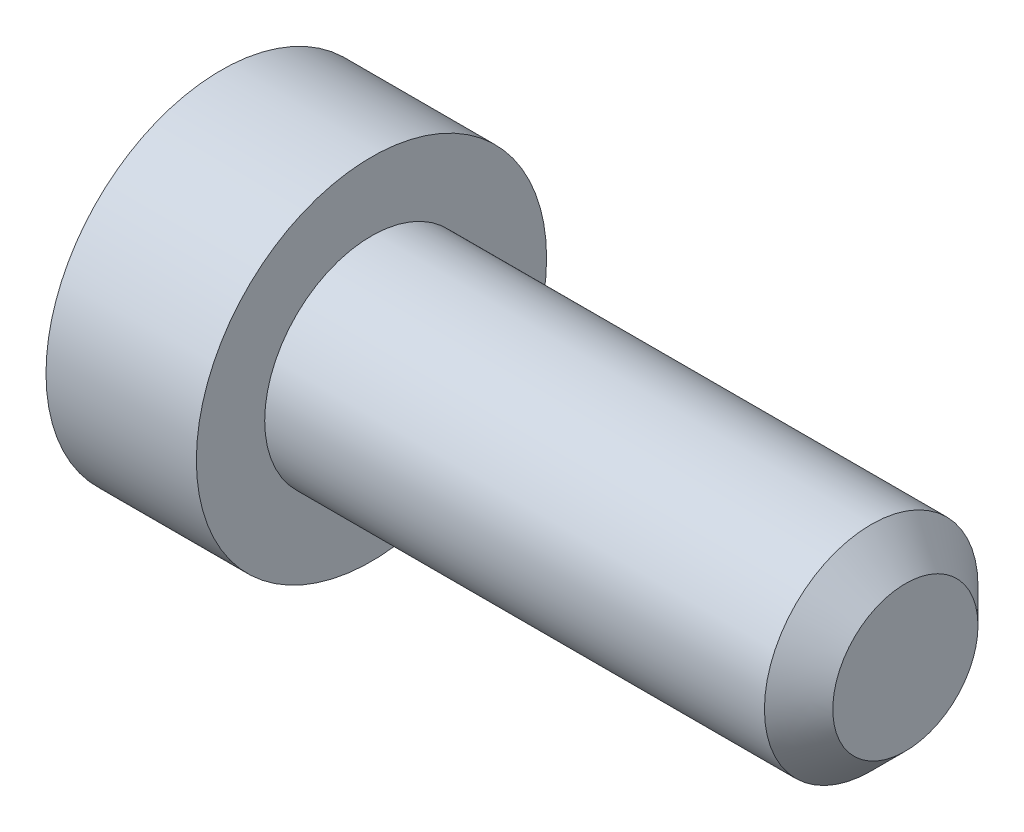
ISO-10303-21;
HEADER;
FILE_DESCRIPTION(('STEP AP214'),'2;1');
FILE_NAME('part.step','',(''),(''),'','','');
FILE_SCHEMA(('AUTOMOTIVE_DESIGN { 1 0 10303 214 1 1 1 1 }'));
ENDSEC;
DATA;
#1=APPLICATION_CONTEXT('core data for automotive mechanical design processes');
#2=APPLICATION_PROTOCOL_DEFINITION('international standard','automotive_design',2000,#1);
#3=PRODUCT_CONTEXT('',#1,'mechanical');
#4=PRODUCT('Part','Part','',(#3));
#5=PRODUCT_RELATED_PRODUCT_CATEGORY('part','',(#4));
#6=PRODUCT_DEFINITION_FORMATION('','',#4);
#7=PRODUCT_DEFINITION_CONTEXT('part definition',#1,'design');
#8=PRODUCT_DEFINITION('design','',#6,#7);
#9=PRODUCT_DEFINITION_SHAPE('','',#8);
#10=(LENGTH_UNIT() NAMED_UNIT(*) SI_UNIT(.MILLI.,.METRE.));
#11=(NAMED_UNIT(*) PLANE_ANGLE_UNIT() SI_UNIT($,.RADIAN.));
#12=(NAMED_UNIT(*) SI_UNIT($,.STERADIAN.) SOLID_ANGLE_UNIT());
#13=UNCERTAINTY_MEASURE_WITH_UNIT(LENGTH_MEASURE(1.E-05),#10,'distance_accuracy_value','');
#14=(GEOMETRIC_REPRESENTATION_CONTEXT(3) GLOBAL_UNCERTAINTY_ASSIGNED_CONTEXT((#13)) GLOBAL_UNIT_ASSIGNED_CONTEXT((#10,
#11,#12)) REPRESENTATION_CONTEXT('',''));
#15=CARTESIAN_POINT('',(0.,0.,0.));
#16=DIRECTION('',(0.,0.,1.));
#17=DIRECTION('',(1.,0.,0.));
#18=AXIS2_PLACEMENT_3D('',#15,#16,#17);
#19=CARTESIAN_POINT('',(4.57606796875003,0.,0.));
#20=DIRECTION('',(-1.,0.,0.));
#21=DIRECTION('',(0.,1.,0.));
#22=AXIS2_PLACEMENT_3D('',#19,#20,#21);
#23=SPHERICAL_SURFACE('',#22,4.57606796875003);
#24=CARTESIAN_POINT('',(0.812799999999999,0.,0.));
#25=DIRECTION('',(-1.,0.,0.));
#26=DIRECTION('',(0.,0.,1.));
#27=AXIS2_PLACEMENT_3D('',#24,#25,#26);
#28=CIRCLE('',#27,2.6035);
#29=CARTESIAN_POINT('',(0.812799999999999,0.,2.6035));
#30=VERTEX_POINT('',#29);
#31=EDGE_CURVE('E155',#30,#30,#28,.T.);
#32=ORIENTED_EDGE('',*,*,#31,.T.);
#33=EDGE_LOOP('',(#32));
#34=FACE_BOUND('',#33,.T.);
#35=CARTESIAN_POINT('',(4.57439831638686,0.,-0.0185277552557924));
#36=DIRECTION('',(-0.089752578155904,0.,-0.99596409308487));
#37=DIRECTION('',(-0.99596409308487,0.,0.089752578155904));
#38=AXIS2_PLACEMENT_3D('',#35,#36,#37);
#39=CIRCLE('',#38,4.57603015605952);
#40=CARTESIAN_POINT('',(0.336878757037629,1.68453425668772,0.363341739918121));
#41=VERTEX_POINT('',#40);
#42=CARTESIAN_POINT('',(0.0334771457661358,0.390683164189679,0.39068316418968));
#43=VERTEX_POINT('',#42);
#44=EDGE_CURVE('E161',#41,#43,#39,.F.);
#45=ORIENTED_EDGE('',*,*,#44,.T.);
#46=CARTESIAN_POINT('',(4.57439831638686,-0.018527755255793,0.));
#47=DIRECTION('',(-0.0897525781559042,-0.99596409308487,0.));
#48=DIRECTION('',(0.995964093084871,-0.0897525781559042,0.));
#49=AXIS2_PLACEMENT_3D('',#46,#47,#48);
#50=CIRCLE('',#49,4.57603015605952);
#51=CARTESIAN_POINT('',(0.336878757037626,0.363341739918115,1.68453425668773));
#52=VERTEX_POINT('',#51);
#53=EDGE_CURVE('E126',#43,#52,#50,.F.);
#54=ORIENTED_EDGE('',*,*,#53,.T.);
#55=CARTESIAN_POINT('',(3.731463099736,0.,-1.0488955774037));
#56=DIRECTION('',(0.627176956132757,0.,0.778876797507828));
#57=DIRECTION('',(0.778876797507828,0.,-0.627176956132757));
#58=AXIS2_PLACEMENT_3D('',#55,#56,#57);
#59=CIRCLE('',#58,4.37342642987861);
#60=CARTESIAN_POINT('',(0.336878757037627,-0.363341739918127,1.68453425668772));
#61=VERTEX_POINT('',#60);
#62=EDGE_CURVE('E261',#61,#52,#59,.F.);
#63=ORIENTED_EDGE('',*,*,#62,.F.);
#64=CARTESIAN_POINT('',(4.57439831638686,0.0185277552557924,0.));
#65=DIRECTION('',(-0.089752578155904,0.99596409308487,0.));
#66=DIRECTION('',(-0.99596409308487,-0.089752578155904,0.));
#67=AXIS2_PLACEMENT_3D('',#64,#65,#66);
#68=CIRCLE('',#67,4.57603015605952);
#69=CARTESIAN_POINT('',(0.033477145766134,-0.390683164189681,0.39068316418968));
#70=VERTEX_POINT('',#69);
#71=EDGE_CURVE('E249',#61,#70,#68,.F.);
#72=ORIENTED_EDGE('',*,*,#71,.T.);
#73=CARTESIAN_POINT('',(0.336878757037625,-1.68453425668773,0.363341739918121));
#74=VERTEX_POINT('',#73);
#75=EDGE_CURVE('E160',#70,#74,#39,.F.);
#76=ORIENTED_EDGE('',*,*,#75,.T.);
#77=CARTESIAN_POINT('',(3.731463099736,1.0488955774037,0.));
#78=DIRECTION('',(0.627176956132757,-0.778876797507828,0.));
#79=DIRECTION('',(0.778876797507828,0.627176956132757,0.));
#80=AXIS2_PLACEMENT_3D('',#77,#78,#79);
#81=CIRCLE('',#80,4.37342642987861);
#82=CARTESIAN_POINT('',(0.336878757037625,-1.68453425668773,-0.363341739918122));
#83=VERTEX_POINT('',#82);
#84=EDGE_CURVE('E158',#83,#74,#81,.F.);
#85=ORIENTED_EDGE('',*,*,#84,.F.);
#86=CARTESIAN_POINT('',(4.57439831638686,0.,0.018527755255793));
#87=DIRECTION('',(-0.0897525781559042,0.,0.99596409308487));
#88=DIRECTION('',(0.995964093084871,0.,0.0897525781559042));
#89=AXIS2_PLACEMENT_3D('',#86,#87,#88);
#90=CIRCLE('',#89,4.57603015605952);
#91=CARTESIAN_POINT('',(0.0334771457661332,-0.390683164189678,-0.39068316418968));
#92=VERTEX_POINT('',#91);
#93=EDGE_CURVE('E164',#83,#92,#90,.F.);
#94=ORIENTED_EDGE('',*,*,#93,.T.);
#95=CARTESIAN_POINT('',(0.336878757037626,-0.363341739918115,-1.68453425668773));
#96=VERTEX_POINT('',#95);
#97=EDGE_CURVE('E254',#92,#96,#68,.F.);
#98=ORIENTED_EDGE('',*,*,#97,.T.);
#99=CARTESIAN_POINT('',(3.731463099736,0.,1.0488955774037));
#100=DIRECTION('',(0.627176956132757,0.,-0.778876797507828));
#101=DIRECTION('',(-0.778876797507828,0.,-0.627176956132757));
#102=AXIS2_PLACEMENT_3D('',#99,#100,#101);
#103=CIRCLE('',#102,4.37342642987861);
#104=CARTESIAN_POINT('',(0.336878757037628,0.363341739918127,-1.68453425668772));
#105=VERTEX_POINT('',#104);
#106=EDGE_CURVE('E250',#105,#96,#103,.F.);
#107=ORIENTED_EDGE('',*,*,#106,.F.);
#108=CARTESIAN_POINT('',(0.0334771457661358,0.390683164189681,-0.39068316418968));
#109=VERTEX_POINT('',#108);
#110=EDGE_CURVE('E105',#105,#109,#50,.F.);
#111=ORIENTED_EDGE('',*,*,#110,.T.);
#112=CARTESIAN_POINT('',(0.336878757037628,1.68453425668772,-0.363341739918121));
#113=VERTEX_POINT('',#112);
#114=EDGE_CURVE('E55',#109,#113,#90,.F.);
#115=ORIENTED_EDGE('',*,*,#114,.T.);
#116=CARTESIAN_POINT('',(3.731463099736,-1.0488955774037,0.));
#117=DIRECTION('',(0.627176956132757,0.778876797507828,0.));
#118=DIRECTION('',(-0.778876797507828,0.627176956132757,0.));
#119=AXIS2_PLACEMENT_3D('',#116,#117,#118);
#120=CIRCLE('',#119,4.37342642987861);
#121=EDGE_CURVE('E132',#41,#113,#120,.F.);
#122=ORIENTED_EDGE('',*,*,#121,.F.);
#123=EDGE_LOOP('',(#45,#54,#63,#72,#76,#85,#94,#98,#107,#111,#115,#122));
#124=FACE_BOUND('',#123,.T.);
#125=ADVANCED_FACE('F32',(#34,#124),#23,.T.);
#126=CARTESIAN_POINT('',(2.42886353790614,0.,-0.174819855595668));
#127=DIRECTION('',(-0.0897525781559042,0.,0.99596409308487));
#128=DIRECTION('',(0.995964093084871,0.,0.0897525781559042));
#129=AXIS2_PLACEMENT_3D('',#126,#127,#128);
#130=PLANE('',#129);
#131=ORIENTED_EDGE('',*,*,#114,.F.);
#132=DIRECTION('',(0.991976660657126,-0.0893932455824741,0.0893932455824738));
#133=VECTOR('',#132,1.);
#134=CARTESIAN_POINT('',(2.44436586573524,0.17342284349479,-0.173422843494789));
#135=LINE('',#134,#133);
#136=CARTESIAN_POINT('',(2.1844,0.196850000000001,-0.196849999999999));
#137=VERTEX_POINT('',#136);
#138=EDGE_CURVE('E104',#109,#137,#135,.T.);
#139=ORIENTED_EDGE('',*,*,#138,.T.);
#140=DIRECTION('',(0.776965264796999,-0.625637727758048,0.0700172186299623));
#141=VECTOR('',#140,1.);
#142=CARTESIAN_POINT('',(0.,1.9558,-0.3937));
#143=LINE('',#142,#141);
#144=EDGE_CURVE('E125',#113,#137,#143,.T.);
#145=ORIENTED_EDGE('',*,*,#144,.F.);
#146=EDGE_LOOP('',(#131,#139,#145));
#147=FACE_BOUND('',#146,.T.);
#148=ADVANCED_FACE('F124',(#147),#130,.T.);
#149=DIRECTION('',(0.776965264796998,0.625637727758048,0.0700172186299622));
#150=VECTOR('',#149,1.);
#151=CARTESIAN_POINT('',(0.,-1.9558,-0.3937));
#152=LINE('',#151,#150);
#153=CARTESIAN_POINT('',(2.1844,-0.19685,-0.19685));
#154=VERTEX_POINT('',#153);
#155=EDGE_CURVE('E47',#83,#154,#152,.T.);
#156=ORIENTED_EDGE('',*,*,#155,.T.);
#157=DIRECTION('',(-0.991976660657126,-0.0893932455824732,-0.0893932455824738));
#158=VECTOR('',#157,1.);
#159=CARTESIAN_POINT('',(2.44436586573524,-0.173422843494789,-0.173422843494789));
#160=LINE('',#159,#158);
#161=EDGE_CURVE('E252',#154,#92,#160,.T.);
#162=ORIENTED_EDGE('',*,*,#161,.T.);
#163=ORIENTED_EDGE('',*,*,#93,.F.);
#164=EDGE_LOOP('',(#156,#162,#163));
#165=FACE_BOUND('',#164,.T.);
#166=ADVANCED_FACE('F191',(#165),#130,.T.);
#167=CARTESIAN_POINT('',(2.42886353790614,0.,0.174819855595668));
#168=DIRECTION('',(-0.089752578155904,0.,-0.99596409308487));
#169=DIRECTION('',(-0.99596409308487,0.,0.089752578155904));
#170=AXIS2_PLACEMENT_3D('',#167,#168,#169);
#171=PLANE('',#170);
#172=DIRECTION('',(0.776965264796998,-0.625637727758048,-0.0700172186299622));
#173=VECTOR('',#172,1.);
#174=CARTESIAN_POINT('',(0.,1.9558,0.3937));
#175=LINE('',#174,#173);
#176=CARTESIAN_POINT('',(2.1844,0.196849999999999,0.196850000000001));
#177=VERTEX_POINT('',#176);
#178=EDGE_CURVE('E134',#41,#177,#175,.T.);
#179=ORIENTED_EDGE('',*,*,#178,.T.);
#180=DIRECTION('',(-0.991976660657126,0.0893932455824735,0.0893932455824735));
#181=VECTOR('',#180,1.);
#182=CARTESIAN_POINT('',(2.44436586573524,0.173422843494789,0.173422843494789));
#183=LINE('',#182,#181);
#184=EDGE_CURVE('E168',#177,#43,#183,.T.);
#185=ORIENTED_EDGE('',*,*,#184,.T.);
#186=ORIENTED_EDGE('',*,*,#44,.F.);
#187=EDGE_LOOP('',(#179,#185,#186));
#188=FACE_BOUND('',#187,.T.);
#189=ADVANCED_FACE('F209',(#188),#171,.T.);
#190=ORIENTED_EDGE('',*,*,#75,.F.);
#191=DIRECTION('',(0.991976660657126,0.0893932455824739,-0.0893932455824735));
#192=VECTOR('',#191,1.);
#193=CARTESIAN_POINT('',(2.44436586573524,-0.17342284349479,0.173422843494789));
#194=LINE('',#193,#192);
#195=CARTESIAN_POINT('',(2.1844,-0.19685,0.19685));
#196=VERTEX_POINT('',#195);
#197=EDGE_CURVE('E245',#70,#196,#194,.T.);
#198=ORIENTED_EDGE('',*,*,#197,.T.);
#199=DIRECTION('',(0.776965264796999,0.625637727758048,-0.0700172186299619));
#200=VECTOR('',#199,1.);
#201=CARTESIAN_POINT('',(0.,-1.9558,0.3937));
#202=LINE('',#201,#200);
#203=EDGE_CURVE('E144',#74,#196,#202,.T.);
#204=ORIENTED_EDGE('',*,*,#203,.F.);
#205=EDGE_LOOP('',(#190,#198,#204));
#206=FACE_BOUND('',#205,.T.);
#207=ADVANCED_FACE('F205',(#206),#171,.T.);
#208=CARTESIAN_POINT('',(-25.4,0.,0.));
#209=DIRECTION('',(-1.,0.,0.));
#210=DIRECTION('',(0.,0.,1.));
#211=AXIS2_PLACEMENT_3D('',#208,#209,#210);
#212=CYLINDRICAL_SURFACE('',#211,1.5875);
#213=CARTESIAN_POINT('',(10.4775,0.,0.));
#214=DIRECTION('',(1.,0.,0.));
#215=DIRECTION('',(0.,0.,-1.));
#216=AXIS2_PLACEMENT_3D('',#213,#214,#215);
#217=CIRCLE('',#216,1.5875);
#218=CARTESIAN_POINT('',(10.4775,0.,-1.5875));
#219=VERTEX_POINT('',#218);
#220=EDGE_CURVE('E40',#219,#219,#217,.F.);
#221=ORIENTED_EDGE('',*,*,#220,.T.);
#222=EDGE_LOOP('',(#221));
#223=FACE_BOUND('',#222,.T.);
#224=CARTESIAN_POINT('',(3.048,0.,0.));
#225=DIRECTION('',(-1.,0.,0.));
#226=DIRECTION('',(0.,0.,1.));
#227=AXIS2_PLACEMENT_3D('',#224,#225,#226);
#228=CIRCLE('',#227,1.5875);
#229=CARTESIAN_POINT('',(3.048,0.,1.5875));
#230=VERTEX_POINT('',#229);
#231=EDGE_CURVE('E133',#230,#230,#228,.T.);
#232=ORIENTED_EDGE('',*,*,#231,.F.);
#233=EDGE_LOOP('',(#232));
#234=FACE_BOUND('',#233,.T.);
#235=ADVANCED_FACE('F34',(#223,#234),#212,.T.);
#236=CARTESIAN_POINT('',(10.9855,1.5875,0.));
#237=DIRECTION('',(1.,0.,0.));
#238=DIRECTION('',(0.,0.,-1.));
#239=AXIS2_PLACEMENT_3D('',#236,#237,#238);
#240=PLANE('',#239);
#241=CARTESIAN_POINT('',(10.9855,0.,0.));
#242=DIRECTION('',(1.,0.,0.));
#243=DIRECTION('',(0.,0.,-1.));
#244=AXIS2_PLACEMENT_3D('',#241,#242,#243);
#245=CIRCLE('',#244,1.0795);
#246=CARTESIAN_POINT('',(10.9855,0.,-1.0795));
#247=VERTEX_POINT('',#246);
#248=EDGE_CURVE('E11',#247,#247,#245,.T.);
#249=ORIENTED_EDGE('',*,*,#248,.T.);
#250=EDGE_LOOP('',(#249));
#251=FACE_BOUND('',#250,.T.);
#252=ADVANCED_FACE('F196',(#251),#240,.T.);
#253=CARTESIAN_POINT('',(-25.4,0.,0.));
#254=DIRECTION('',(-1.,0.,0.));
#255=DIRECTION('',(0.,0.,1.));
#256=AXIS2_PLACEMENT_3D('',#253,#254,#255);
#257=CYLINDRICAL_SURFACE('',#256,2.6035);
#258=ORIENTED_EDGE('',*,*,#31,.F.);
#259=EDGE_LOOP('',(#258));
#260=FACE_BOUND('',#259,.T.);
#261=CARTESIAN_POINT('',(3.048,0.,0.));
#262=DIRECTION('',(-1.,0.,0.));
#263=DIRECTION('',(0.,0.,1.));
#264=AXIS2_PLACEMENT_3D('',#261,#262,#263);
#265=CIRCLE('',#264,2.6035);
#266=CARTESIAN_POINT('',(3.048,0.,2.6035));
#267=VERTEX_POINT('',#266);
#268=EDGE_CURVE('E152',#267,#267,#265,.T.);
#269=ORIENTED_EDGE('',*,*,#268,.T.);
#270=EDGE_LOOP('',(#269));
#271=FACE_BOUND('',#270,.T.);
#272=ADVANCED_FACE('F194',(#260,#271),#257,.T.);
#273=CARTESIAN_POINT('',(3.048,1.5875,0.));
#274=DIRECTION('',(-1.,0.,0.));
#275=DIRECTION('',(0.,0.,1.));
#276=AXIS2_PLACEMENT_3D('',#273,#274,#275);
#277=PLANE('',#276);
#278=ORIENTED_EDGE('',*,*,#268,.F.);
#279=EDGE_LOOP('',(#278));
#280=FACE_BOUND('',#279,.T.);
#281=ORIENTED_EDGE('',*,*,#231,.T.);
#282=EDGE_LOOP('',(#281));
#283=FACE_BOUND('',#282,.T.);
#284=ADVANCED_FACE('F203',(#280,#283),#277,.F.);
#285=CARTESIAN_POINT('',(2.1844,0.19685,-0.19685));
#286=DIRECTION('',(-1.,0.,0.));
#287=DIRECTION('',(0.,0.,1.));
#288=AXIS2_PLACEMENT_3D('',#285,#286,#287);
#289=PLANE('',#288);
#290=DIRECTION('',(0.,1.,0.));
#291=VECTOR('',#290,1.);
#292=CARTESIAN_POINT('',(2.1844,-0.19685,-0.19685));
#293=LINE('',#292,#291);
#294=EDGE_CURVE('E112',#154,#137,#293,.T.);
#295=ORIENTED_EDGE('',*,*,#294,.F.);
#296=DIRECTION('',(0.,0.,1.));
#297=VECTOR('',#296,1.);
#298=CARTESIAN_POINT('',(2.1844,-0.19685,-0.19685));
#299=LINE('',#298,#297);
#300=EDGE_CURVE('E140',#154,#196,#299,.T.);
#301=ORIENTED_EDGE('',*,*,#300,.T.);
#302=DIRECTION('',(0.,-1.,0.));
#303=VECTOR('',#302,1.);
#304=CARTESIAN_POINT('',(2.1844,0.19685,0.19685));
#305=LINE('',#304,#303);
#306=EDGE_CURVE('E138',#177,#196,#305,.T.);
#307=ORIENTED_EDGE('',*,*,#306,.F.);
#308=DIRECTION('',(0.,0.,-1.));
#309=VECTOR('',#308,1.);
#310=CARTESIAN_POINT('',(2.1844,0.19685,0.19685));
#311=LINE('',#310,#309);
#312=EDGE_CURVE('E119',#177,#137,#311,.T.);
#313=ORIENTED_EDGE('',*,*,#312,.T.);
#314=EDGE_LOOP('',(#295,#301,#307,#313));
#315=FACE_BOUND('',#314,.T.);
#316=ADVANCED_FACE('F137',(#315),#289,.T.);
#317=CARTESIAN_POINT('',(2.1844,0.19685,0.19685));
#318=DIRECTION('',(0.627176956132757,0.778876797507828,0.));
#319=DIRECTION('',(-0.778876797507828,0.627176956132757,0.));
#320=AXIS2_PLACEMENT_3D('',#317,#318,#319);
#321=PLANE('',#320);
#322=ORIENTED_EDGE('',*,*,#121,.T.);
#323=ORIENTED_EDGE('',*,*,#144,.T.);
#324=ORIENTED_EDGE('',*,*,#312,.F.);
#325=ORIENTED_EDGE('',*,*,#178,.F.);
#326=EDGE_LOOP('',(#322,#323,#324,#325));
#327=FACE_BOUND('',#326,.T.);
#328=ADVANCED_FACE('F130',(#327),#321,.F.);
#329=CARTESIAN_POINT('',(2.1844,-0.19685,-0.19685));
#330=DIRECTION('',(0.627176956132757,-0.778876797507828,0.));
#331=DIRECTION('',(0.778876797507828,0.627176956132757,0.));
#332=AXIS2_PLACEMENT_3D('',#329,#330,#331);
#333=PLANE('',#332);
#334=ORIENTED_EDGE('',*,*,#84,.T.);
#335=ORIENTED_EDGE('',*,*,#203,.T.);
#336=ORIENTED_EDGE('',*,*,#300,.F.);
#337=ORIENTED_EDGE('',*,*,#155,.F.);
#338=EDGE_LOOP('',(#334,#335,#336,#337));
#339=FACE_BOUND('',#338,.T.);
#340=ADVANCED_FACE('F218',(#339),#333,.F.);
#341=CARTESIAN_POINT('',(2.42886353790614,0.174819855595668,0.));
#342=DIRECTION('',(-0.0897525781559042,-0.99596409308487,0.));
#343=DIRECTION('',(0.995964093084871,-0.0897525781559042,0.));
#344=AXIS2_PLACEMENT_3D('',#341,#342,#343);
#345=PLANE('',#344);
#346=ORIENTED_EDGE('',*,*,#184,.F.);
#347=DIRECTION('',(0.776965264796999,-0.0700172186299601,-0.625637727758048));
#348=VECTOR('',#347,1.);
#349=CARTESIAN_POINT('',(0.,0.393699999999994,1.9558));
#350=LINE('',#349,#348);
#351=EDGE_CURVE('E255',#52,#177,#350,.T.);
#352=ORIENTED_EDGE('',*,*,#351,.F.);
#353=ORIENTED_EDGE('',*,*,#53,.F.);
#354=EDGE_LOOP('',(#346,#352,#353));
#355=FACE_BOUND('',#354,.T.);
#356=ADVANCED_FACE('F222',(#355),#345,.T.);
#357=CARTESIAN_POINT('',(2.42886353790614,-0.174819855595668,0.));
#358=DIRECTION('',(-0.089752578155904,0.99596409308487,0.));
#359=DIRECTION('',(-0.99596409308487,-0.089752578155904,0.));
#360=AXIS2_PLACEMENT_3D('',#357,#358,#359);
#361=PLANE('',#360);
#362=DIRECTION('',(0.776965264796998,0.0700172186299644,-0.625637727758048));
#363=VECTOR('',#362,1.);
#364=CARTESIAN_POINT('',(0.,-0.393700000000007,1.9558));
#365=LINE('',#364,#363);
#366=EDGE_CURVE('E108',#61,#196,#365,.T.);
#367=ORIENTED_EDGE('',*,*,#366,.T.);
#368=ORIENTED_EDGE('',*,*,#197,.F.);
#369=ORIENTED_EDGE('',*,*,#71,.F.);
#370=EDGE_LOOP('',(#367,#368,#369));
#371=FACE_BOUND('',#370,.T.);
#372=ADVANCED_FACE('F239',(#371),#361,.T.);
#373=CARTESIAN_POINT('',(2.1844,-0.196850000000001,0.196849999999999));
#374=DIRECTION('',(0.627176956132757,0.,0.778876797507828));
#375=DIRECTION('',(-0.778876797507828,0.,0.627176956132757));
#376=AXIS2_PLACEMENT_3D('',#373,#374,#375);
#377=PLANE('',#376);
#378=ORIENTED_EDGE('',*,*,#62,.T.);
#379=ORIENTED_EDGE('',*,*,#351,.T.);
#380=ORIENTED_EDGE('',*,*,#306,.T.);
#381=ORIENTED_EDGE('',*,*,#366,.F.);
#382=EDGE_LOOP('',(#378,#379,#380,#381));
#383=FACE_BOUND('',#382,.T.);
#384=ADVANCED_FACE('F272',(#383),#377,.F.);
#385=DIRECTION('',(0.776965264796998,-0.0700172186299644,0.625637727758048));
#386=VECTOR('',#385,1.);
#387=CARTESIAN_POINT('',(0.,0.393700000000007,-1.9558));
#388=LINE('',#387,#386);
#389=EDGE_CURVE('E100',#105,#137,#388,.T.);
#390=ORIENTED_EDGE('',*,*,#389,.T.);
#391=ORIENTED_EDGE('',*,*,#138,.F.);
#392=ORIENTED_EDGE('',*,*,#110,.F.);
#393=EDGE_LOOP('',(#390,#391,#392));
#394=FACE_BOUND('',#393,.T.);
#395=ADVANCED_FACE('F102',(#394),#345,.T.);
#396=ORIENTED_EDGE('',*,*,#161,.F.);
#397=DIRECTION('',(0.776965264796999,0.0700172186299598,0.625637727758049));
#398=VECTOR('',#397,1.);
#399=CARTESIAN_POINT('',(0.,-0.393699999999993,-1.9558));
#400=LINE('',#399,#398);
#401=EDGE_CURVE('E109',#96,#154,#400,.T.);
#402=ORIENTED_EDGE('',*,*,#401,.F.);
#403=ORIENTED_EDGE('',*,*,#97,.F.);
#404=EDGE_LOOP('',(#396,#402,#403));
#405=FACE_BOUND('',#404,.T.);
#406=ADVANCED_FACE('F182',(#405),#361,.T.);
#407=CARTESIAN_POINT('',(2.1844,0.196850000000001,-0.196849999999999));
#408=DIRECTION('',(0.627176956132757,0.,-0.778876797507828));
#409=DIRECTION('',(0.778876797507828,0.,0.627176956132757));
#410=AXIS2_PLACEMENT_3D('',#407,#408,#409);
#411=PLANE('',#410);
#412=ORIENTED_EDGE('',*,*,#106,.T.);
#413=ORIENTED_EDGE('',*,*,#401,.T.);
#414=ORIENTED_EDGE('',*,*,#294,.T.);
#415=ORIENTED_EDGE('',*,*,#389,.F.);
#416=EDGE_LOOP('',(#412,#413,#414,#415));
#417=FACE_BOUND('',#416,.T.);
#418=ADVANCED_FACE('F113',(#417),#411,.F.);
#419=CARTESIAN_POINT('',(10.4775,0.,0.));
#420=DIRECTION('',(-1.,0.,0.));
#421=DIRECTION('',(0.,0.,1.));
#422=AXIS2_PLACEMENT_3D('',#419,#420,#421);
#423=CONICAL_SURFACE('',#422,1.5875,0.785398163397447);
#424=ORIENTED_EDGE('',*,*,#248,.F.);
#425=EDGE_LOOP('',(#424));
#426=FACE_BOUND('',#425,.T.);
#427=ORIENTED_EDGE('',*,*,#220,.F.);
#428=EDGE_LOOP('',(#427));
#429=FACE_BOUND('',#428,.T.);
#430=ADVANCED_FACE('F175',(#426,#429),#423,.T.);
#431=CLOSED_SHELL('',(#125,#148,#166,#189,#207,#235,#252,#272,#284,#316,#328,#340,#356,#372,
#384,#395,#406,#418,#430));
#432=MANIFOLD_SOLID_BREP('B2',#431);
#433=ADVANCED_BREP_SHAPE_REPRESENTATION('',(#18,#432),#14);
#434=SHAPE_DEFINITION_REPRESENTATION(#9,#433);
ENDSEC;
END-ISO-10303-21;
